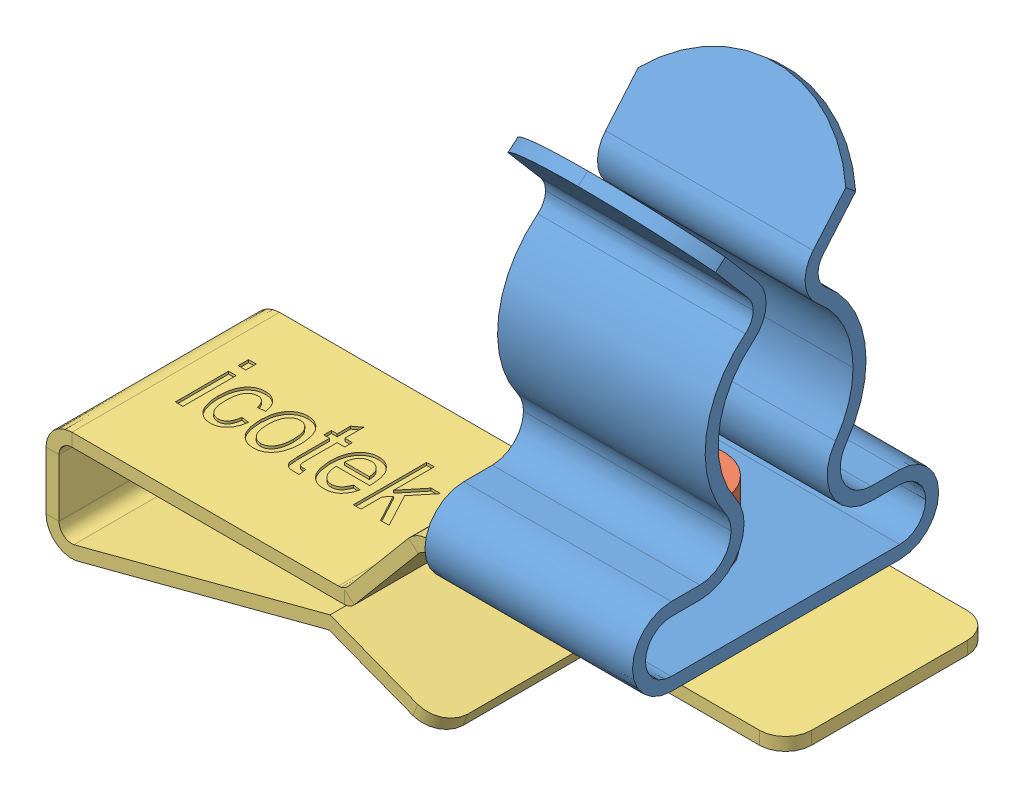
SolidWorks assembly 36786_3.SLDASM, configuration Default (file format 8000). Lengths in mm.
Overall size (28.5 22.5 11.8).
3 component instances, 3 part files, 0 mates.
Components (placement in the parent):
- 36786_3_01-1: 36786_3_01.SLDPRT [Default] at origin size (8 14.98 11.8)
- 36786_3_02-1: 36786_3_02.SLDPRT [Default] at origin size (6 4.5 6)
- 36786_3_03-1: 36786_3_03.SLDPRT [Default] at origin size (28.5 7.52 8)
